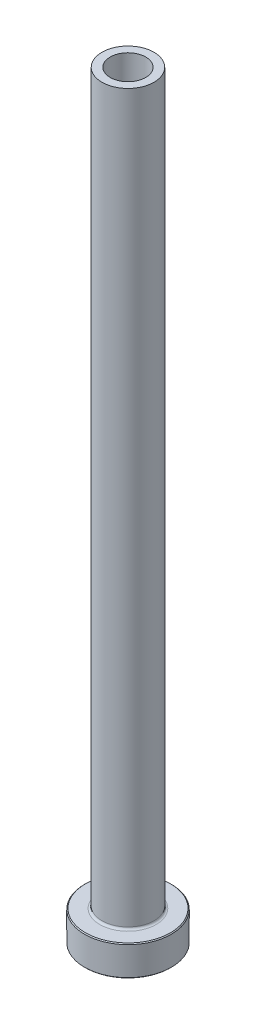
from build123d import *

# Parameters (mm, degrees)
FILLET1_R     = 0.5
CHAMFER1_SIZE = 0.2
CHAMFER3_SIZE = 0.5


with BuildPart() as part:
    # Sketch1 → Revolve1 (revolve)
    with BuildSketch(Plane.XY, mode=Mode.PRIVATE) as revolve1_sk:
        Polygon((-4.1, 175), (-6, 175), (-6, 7), (-10, 7), (-10, 0), (-4.35, 0), (-4.35, 118), (-4.1, 130), align=None)
    revolve(revolve1_sk.sketch.rotate(Axis((0, 92.187680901, 0), (0, -1, 0)), 270), axis=Axis((0, 92.187680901, 0), (0, -1, 0)))

    # Fillet1
    fillet1_edges = [part.edges().sort_by_distance(p)[0] for p in [
        (0, 7, -6),
    ]]
    fillet(fillet1_edges, radius=FILLET1_R)

    # Chamfer1
    chamfer1_edges = [part.edges().sort_by_distance(p)[0] for p in [
        (0, 0, -10),
        (0, 7, -10),
    ]]
    chamfer(chamfer1_edges, length=CHAMFER1_SIZE)

    # Chamfer3
    chamfer3_edges = [part.edges().sort_by_distance(p)[0] for p in [
        (0, 0, -4.35),
    ]]
    chamfer(chamfer3_edges, length=CHAMFER3_SIZE)


solid = part.part
